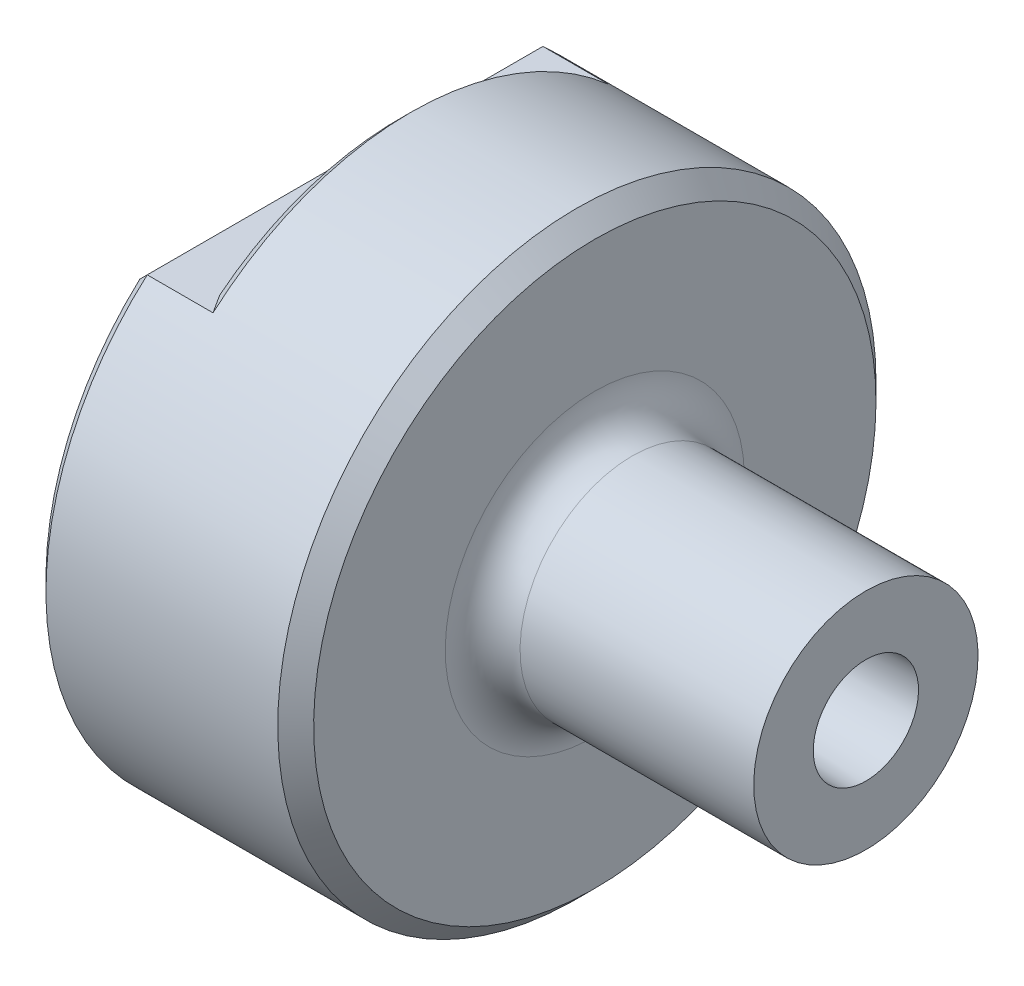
from build123d import *

# Parameters (mm, degrees)
SKETCH1_R           = 25.4
BOSS_EXTRUDE1_DEPTH = 22.621875
SKETCH3_W           = 50.8
SKETCH3_H           = 6.35
CUT_EXTRUDE1_DEPTH  = 5.588
SKETCH5_W           = 23.01875
SKETCH5_H           = 15.875
FILLET1_R           = 3.175
CHAMFER1_SIZE       = 1.524
CHAMFER2_SIZE       = 1.016


with BuildPart() as part:
    # Sketch1 → Boss-Extrude1 (new, symmetric)
    with BuildSketch(Plane(origin=(0, 0, 0), x_dir=(0, 0, -1), z_dir=(1, 0, 0))):
        Circle(SKETCH1_R)
    extrude(amount=BOSS_EXTRUDE1_DEPTH, both=True)

    # Sketch3 → Cut-Extrude1 (cut)
    with BuildSketch(Plane.ZY.offset(22.621875)):
        with Locations((0, 22.225)):
            Rectangle(SKETCH3_W, SKETCH3_H)
    extrude(amount=-CUT_EXTRUDE1_DEPTH, mode=Mode.SUBTRACT)

    # Sketch5 → Cut-Revolve1 (revolve, cut)
    with BuildSketch(Plane.XY, mode=Mode.PRIVATE) as cut_revolve1_sk:
        with Locations((11.1125, -17.4625)):
            Rectangle(SKETCH5_W, SKETCH5_H)
    revolve(cut_revolve1_sk.sketch.rotate(Axis((22.621875, 0, 0), (-1, 0, 0)), 138.590377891), axis=Axis((22.621875, 0, 0), (-1, 0, 0)), mode=Mode.SUBTRACT)

    # Sketch6 → Cut-Revolve2 (revolve, cut)
    with BuildSketch(Plane.XY):
        with BuildLine():
            Line((-17.999075, 0), (-22.621875, 0))
            Line((-22.621875, 0), (-22.621875, 9.800451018))
            ThreePointArc((-22.621875, 9.800451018), (-19.212769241, 5.418005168), (-17.999075, 0))
        make_face()
    revolve(axis=Axis((22.621875, 0, 0), (-1, 0, 0)), mode=Mode.SUBTRACT)

    # Sketch7 → Cut-Revolve3 (revolve, cut)
    with BuildSketch(Plane.XY):
        Polygon((-18.511716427, 3.571875), (22.621875, 4.469413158), (22.621875, 0), (-18.511716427, 0), align=None)
    revolve(axis=Axis((22.621875, 0, 0), (-1, 0, 0)), mode=Mode.SUBTRACT)

    # Fillet1
    fillet1_edges = [part.edges().sort_by_distance(p)[0] for p in [
        (-0.396875, -7.14375, -6.300195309),
    ]]
    fillet(fillet1_edges, radius=FILLET1_R)

    # Chamfer1
    chamfer1_edges = [part.edges().sort_by_distance(p)[0] for p in [
        (-0.396875, 0, 25.4),
    ]]
    chamfer(chamfer1_edges, length=CHAMFER1_SIZE)

    # Chamfer2
    chamfer2_edges = [part.edges().sort_by_distance(p)[0] for p in [
        (-22.621875, -23.150520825, 10.450520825),
        (-22.621875, 19.05, 0),
        (-17.033875, 25.4, 0),
    ]]
    chamfer(chamfer2_edges, length=CHAMFER2_SIZE)


solid = part.part
